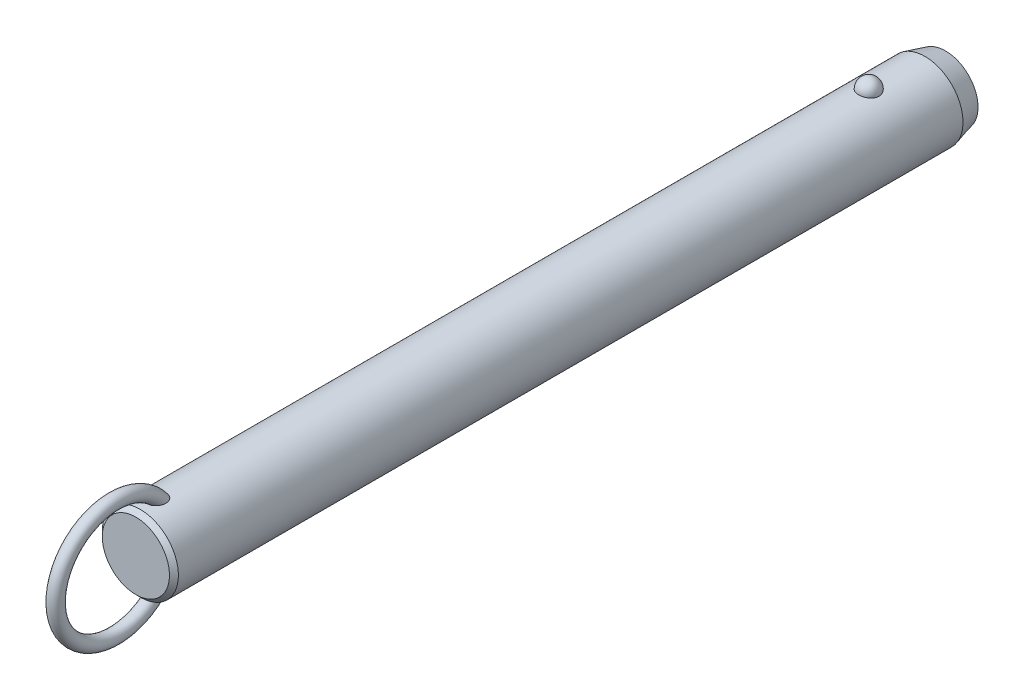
ISO-10303-21;
HEADER;
FILE_DESCRIPTION(('STEP AP214'),'2;1');
FILE_NAME('part.step','',(''),(''),'','','');
FILE_SCHEMA(('AUTOMOTIVE_DESIGN { 1 0 10303 214 1 1 1 1 }'));
ENDSEC;
DATA;
#1=APPLICATION_CONTEXT('core data for automotive mechanical design processes');
#2=APPLICATION_PROTOCOL_DEFINITION('international standard','automotive_design',2000,#1);
#3=PRODUCT_CONTEXT('',#1,'mechanical');
#4=PRODUCT('Part','Part','',(#3));
#5=PRODUCT_RELATED_PRODUCT_CATEGORY('part','',(#4));
#6=PRODUCT_DEFINITION_FORMATION('','',#4);
#7=PRODUCT_DEFINITION_CONTEXT('part definition',#1,'design');
#8=PRODUCT_DEFINITION('design','',#6,#7);
#9=PRODUCT_DEFINITION_SHAPE('','',#8);
#10=(LENGTH_UNIT() NAMED_UNIT(*) SI_UNIT(.MILLI.,.METRE.));
#11=(NAMED_UNIT(*) PLANE_ANGLE_UNIT() SI_UNIT($,.RADIAN.));
#12=(NAMED_UNIT(*) SI_UNIT($,.STERADIAN.) SOLID_ANGLE_UNIT());
#13=UNCERTAINTY_MEASURE_WITH_UNIT(LENGTH_MEASURE(1.E-05),#10,'distance_accuracy_value','');
#14=(GEOMETRIC_REPRESENTATION_CONTEXT(3) GLOBAL_UNCERTAINTY_ASSIGNED_CONTEXT((#13)) GLOBAL_UNIT_ASSIGNED_CONTEXT((#10,
#11,#12)) REPRESENTATION_CONTEXT('',''));
#15=CARTESIAN_POINT('',(0.,0.,0.));
#16=DIRECTION('',(0.,0.,1.));
#17=DIRECTION('',(1.,0.,0.));
#18=AXIS2_PLACEMENT_3D('',#15,#16,#17);
#19=CARTESIAN_POINT('',(0.,0.,198.1));
#20=DIRECTION('',(0.,0.,-1.));
#21=DIRECTION('',(-1.,0.,0.));
#22=AXIS2_PLACEMENT_3D('',#19,#20,#21);
#23=CYLINDRICAL_SURFACE('',#22,11.1);
#24=CARTESIAN_POINT('',(2.9724815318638,10.6945945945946,-3.00000000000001));
#25=CARTESIAN_POINT('',(2.97247830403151,10.6945972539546,-2.8322505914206));
#26=CARTESIAN_POINT('',(2.95876598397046,10.6984356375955,-2.66445972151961));
#27=CARTESIAN_POINT('',(2.90424529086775,10.7133624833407,-2.3336238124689));
#28=CARTESIAN_POINT('',(2.8634252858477,10.7244540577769,-2.17058084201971));
#29=CARTESIAN_POINT('',(2.75573657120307,10.7526272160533,-1.85396767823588));
#30=CARTESIAN_POINT('',(2.68887937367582,10.7697061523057,-1.70039333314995));
#31=CARTESIAN_POINT('',(2.53079696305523,10.8079438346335,-1.4069159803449));
#32=CARTESIAN_POINT('',(2.43957264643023,10.8291024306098,-1.26701246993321));
#33=CARTESIAN_POINT('',(2.23458150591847,10.8732541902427,-1.00409565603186));
#34=CARTESIAN_POINT('',(2.12071295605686,10.8962553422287,-0.881162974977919));
#35=CARTESIAN_POINT('',(1.87365402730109,10.9414421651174,-0.656352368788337));
#36=CARTESIAN_POINT('',(1.74046358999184,10.9636278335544,-0.554474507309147));
#37=CARTESIAN_POINT('',(1.45872188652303,11.0046495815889,-0.374872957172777));
#38=CARTESIAN_POINT('',(1.31021276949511,11.0234944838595,-0.297085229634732));
#39=CARTESIAN_POINT('',(1.00170030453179,11.0557957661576,-0.167529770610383));
#40=CARTESIAN_POINT('',(0.841698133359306,11.0692526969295,-0.1157593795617));
#41=CARTESIAN_POINT('',(0.517607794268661,11.0890932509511,-0.0403925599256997));
#42=CARTESIAN_POINT('',(0.353633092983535,11.0955916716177,-0.0163383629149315));
#43=CARTESIAN_POINT('',(0.0238420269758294,11.1011989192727,0.00445177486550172));
#44=CARTESIAN_POINT('',(-0.141974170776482,11.1003084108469,0.00119017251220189));
#45=CARTESIAN_POINT('',(-0.468405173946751,11.0912990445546,-0.0323233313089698));
#46=CARTESIAN_POINT('',(-0.629059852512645,11.0832767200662,-0.062214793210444));
#47=CARTESIAN_POINT('',(-0.942937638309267,11.0609962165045,-0.147645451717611));
#48=CARTESIAN_POINT('',(-1.09616062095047,11.0467379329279,-0.203185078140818));
#49=CARTESIAN_POINT('',(-1.39181061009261,11.0134071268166,-0.338752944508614));
#50=CARTESIAN_POINT('',(-1.53417383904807,10.9943086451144,-0.418913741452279));
#51=CARTESIAN_POINT('',(-1.80342160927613,10.9533667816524,-0.601448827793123));
#52=CARTESIAN_POINT('',(-1.9303046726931,10.9315231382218,-0.703825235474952));
#53=CARTESIAN_POINT('',(-2.16747598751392,10.887005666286,-0.930091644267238));
#54=CARTESIAN_POINT('',(-2.27742774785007,10.8643239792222,-1.05433291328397));
#55=CARTESIAN_POINT('',(-2.47517316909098,10.8209886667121,-1.31966633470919));
#56=CARTESIAN_POINT('',(-2.56296538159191,10.8003351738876,-1.46075958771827));
#57=CARTESIAN_POINT('',(-2.71500300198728,10.7631304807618,-1.75753646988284));
#58=CARTESIAN_POINT('',(-2.77898901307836,10.7466250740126,-1.91335887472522));
#59=CARTESIAN_POINT('',(-2.88046189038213,10.7198747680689,-2.23391529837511));
#60=CARTESIAN_POINT('',(-2.91794947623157,10.709629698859,-2.3986490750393));
#61=CARTESIAN_POINT('',(-2.96537819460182,10.6965949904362,-2.73165170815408));
#62=CARTESIAN_POINT('',(-2.97542891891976,10.693775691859,-2.89990378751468));
#63=CARTESIAN_POINT('',(-2.96804271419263,10.6958279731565,-3.23575286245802));
#64=CARTESIAN_POINT('',(-2.95060646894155,10.7006993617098,-3.4033498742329));
#65=CARTESIAN_POINT('',(-2.88883358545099,10.71753912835,-3.73233906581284));
#66=CARTESIAN_POINT('',(-2.84462026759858,10.7294749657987,-3.89375610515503));
#67=CARTESIAN_POINT('',(-2.73050447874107,10.7590797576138,-4.20667949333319));
#68=CARTESIAN_POINT('',(-2.66060103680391,10.7767489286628,-4.35818546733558));
#69=CARTESIAN_POINT('',(-2.49642559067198,10.8159599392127,-4.64785421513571));
#70=CARTESIAN_POINT('',(-2.40203047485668,10.8375211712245,-4.78594458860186));
#71=CARTESIAN_POINT('',(-2.19143488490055,10.8820570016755,-5.04410382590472));
#72=CARTESIAN_POINT('',(-2.07523364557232,10.9050316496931,-5.16417205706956));
#73=CARTESIAN_POINT('',(-1.82361254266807,10.9499219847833,-5.3833483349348));
#74=CARTESIAN_POINT('',(-1.68812945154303,10.9718338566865,-5.48238464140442));
#75=CARTESIAN_POINT('',(-1.40191298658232,11.0120611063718,-5.65618873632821));
#76=CARTESIAN_POINT('',(-1.25118062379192,11.0303767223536,-5.73095813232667));
#77=CARTESIAN_POINT('',(-0.940570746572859,11.0611653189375,-5.85334725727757));
#78=CARTESIAN_POINT('',(-0.780821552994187,11.0737044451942,-5.90127578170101));
#79=CARTESIAN_POINT('',(-0.455204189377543,11.0918598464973,-5.96992976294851));
#80=CARTESIAN_POINT('',(-0.289336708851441,11.0974768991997,-5.99065827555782));
#81=CARTESIAN_POINT('',(0.0406846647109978,11.1011307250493,-6.00418773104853));
#82=CARTESIAN_POINT('',(0.204817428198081,11.099299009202,-5.9974731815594));
#83=CARTESIAN_POINT('',(0.5295530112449,11.088551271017,-5.95740317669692));
#84=CARTESIAN_POINT('',(0.69015594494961,11.0796354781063,-5.92404858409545));
#85=CARTESIAN_POINT('',(1.0027760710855,11.0557204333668,-5.83180084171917));
#86=CARTESIAN_POINT('',(1.15482001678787,11.0407414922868,-5.7729929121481));
#87=CARTESIAN_POINT('',(1.44678373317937,11.0062913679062,-5.63147366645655));
#88=CARTESIAN_POINT('',(1.58670279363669,10.9868199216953,-5.54876095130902));
#89=CARTESIAN_POINT('',(1.8527023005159,10.9451315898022,-5.36027644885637));
#90=CARTESIAN_POINT('',(1.97855158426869,10.9228788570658,-5.25418644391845));
#91=CARTESIAN_POINT('',(2.21080872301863,10.8782509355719,-5.02251354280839));
#92=CARTESIAN_POINT('',(2.31721312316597,10.8558757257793,-4.89692718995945));
#93=CARTESIAN_POINT('',(2.5094551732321,10.8130715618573,-4.62745408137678));
#94=CARTESIAN_POINT('',(2.59493284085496,10.7926798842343,-4.48330448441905));
#95=CARTESIAN_POINT('',(2.740862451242,10.7565495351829,-4.18236358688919));
#96=CARTESIAN_POINT('',(2.80132490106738,10.7408089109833,-4.02557762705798));
#97=CARTESIAN_POINT('',(2.88959070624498,10.7173718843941,-3.72475308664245));
#98=CARTESIAN_POINT('',(2.92062102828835,10.7088950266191,-3.58171216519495));
#99=CARTESIAN_POINT('',(2.96206765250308,10.6975052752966,-3.29245795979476));
#100=CARTESIAN_POINT('',(2.97248434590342,10.6945922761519,-3.14624473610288));
#101=CARTESIAN_POINT('',(2.9724815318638,10.6945945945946,-3.00000000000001));
#102=B_SPLINE_CURVE_WITH_KNOTS('',3,(#24,#25,#26,#27,#28,#29,#30,#31,#32,#33,#34,#35,#36,#37,
#38,#39,#40,#41,#42,#43,#44,#45,#46,#47,#48,#49,#50,#51,#52,#53,#54,#55,#56,#57,#58,#59,#60,#61,
#62,#63,#64,#65,#66,#67,#68,#69,#70,#71,#72,#73,#74,#75,#76,#77,#78,#79,#80,#81,#82,#83,#84,#85,
#86,#87,#88,#89,#90,#91,#92,#93,#94,#95,#96,#97,#98,#99,#100,#101),.UNSPECIFIED.,.T.,.F.,(4,2,2,
2,2,2,2,2,2,2,2,2,2,2,2,2,2,2,2,2,2,2,2,2,2,2,2,2,2,2,2,2,2,2,2,2,2,2,4),(0.,0.502722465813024,
1.00566079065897,1.5083769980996,2.01107471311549,2.51608392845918,3.02109467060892,
3.52475118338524,4.02835620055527,4.523518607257,5.0186364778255,5.50715297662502,
5.9956776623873,6.48688002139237,6.97812923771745,7.47814366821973,7.9781907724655,
8.48353712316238,8.9888697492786,9.49218093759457,9.99547960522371,10.4964777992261,
10.997494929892,11.5010810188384,12.0046847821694,12.5099796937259,13.0152411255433,
13.5145635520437,14.0138298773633,14.5043200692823,14.9947943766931,15.4836390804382,
15.9725123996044,16.4685040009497,16.9645836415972,17.4686765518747,17.972557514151,
18.410841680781,18.849117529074),.UNSPECIFIED.);
#103=CARTESIAN_POINT('',(2.9724815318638,10.6945945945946,-3.00000000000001));
#104=VERTEX_POINT('',#103);
#105=EDGE_CURVE('E41',#104,#104,#102,.T.);
#106=ORIENTED_EDGE('',*,*,#105,.T.);
#107=EDGE_LOOP('',(#106));
#108=FACE_BOUND('',#107,.T.);
#109=CARTESIAN_POINT('',(0.,0.,209.5));
#110=DIRECTION('',(0.,0.,1.));
#111=DIRECTION('',(1.,0.,0.));
#112=AXIS2_PLACEMENT_3D('',#109,#110,#111);
#113=CIRCLE('',#112,11.1);
#114=CARTESIAN_POINT('',(-11.1,0.,209.5));
#115=VERTEX_POINT('',#114);
#116=EDGE_CURVE('E10',#115,#115,#113,.F.);
#117=ORIENTED_EDGE('',*,*,#116,.T.);
#118=EDGE_LOOP('',(#117));
#119=FACE_BOUND('',#118,.T.);
#120=CARTESIAN_POINT('',(-0.564520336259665,-11.0856356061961,201.757815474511));
#121=CARTESIAN_POINT('',(-0.667202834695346,-11.0804062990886,201.791283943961));
#122=CARTESIAN_POINT('',(-0.766875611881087,-11.0738877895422,201.833835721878));
#123=CARTESIAN_POINT('',(-0.95728412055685,-11.0590576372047,201.935419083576));
#124=CARTESIAN_POINT('',(-1.04801616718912,-11.0507452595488,201.99445742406));
#125=CARTESIAN_POINT('',(-1.21800952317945,-11.0333016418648,202.126529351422));
#126=CARTESIAN_POINT('',(-1.2973080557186,-11.0241732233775,202.199515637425));
#127=CARTESIAN_POINT('',(-1.44337665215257,-11.0060026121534,202.357037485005));
#128=CARTESIAN_POINT('',(-1.51014622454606,-10.9969604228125,202.441573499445));
#129=CARTESIAN_POINT('',(-1.63454620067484,-10.9791841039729,202.625521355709));
#130=CARTESIAN_POINT('',(-1.69127003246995,-10.9705107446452,202.725549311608));
#131=CARTESIAN_POINT('',(-1.7898078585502,-10.9548648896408,202.932790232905));
#132=CARTESIAN_POINT('',(-1.83161214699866,-10.9478935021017,203.040007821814));
#133=CARTESIAN_POINT('',(-1.91557028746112,-10.9335803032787,203.305408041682));
#134=CARTESIAN_POINT('',(-1.95040620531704,-10.9273269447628,203.465980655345));
#135=CARTESIAN_POINT('',(-1.99388326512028,-10.9194709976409,203.790697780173));
#136=CARTESIAN_POINT('',(-2.00248051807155,-10.9178762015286,203.954847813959));
#137=CARTESIAN_POINT('',(-1.99551615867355,-10.9191578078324,204.324650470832));
#138=CARTESIAN_POINT('',(-1.9732206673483,-10.9232807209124,204.530191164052));
#139=CARTESIAN_POINT('',(-1.9152976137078,-10.9335244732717,204.833595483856));
#140=CARTESIAN_POINT('',(-1.89184575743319,-10.9376266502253,204.934088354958));
#141=CARTESIAN_POINT('',(-1.83700674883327,-10.9469720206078,205.132855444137));
#142=CARTESIAN_POINT('',(-1.80562070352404,-10.9522150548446,205.231129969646));
#143=CARTESIAN_POINT('',(-1.73463055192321,-10.9636837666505,205.425914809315));
#144=CARTESIAN_POINT('',(-1.69493416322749,-10.9699202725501,205.522390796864));
#145=CARTESIAN_POINT('',(-1.60745141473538,-10.9830806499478,205.711626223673));
#146=CARTESIAN_POINT('',(-1.55966150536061,-10.9900048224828,205.804384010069));
#147=CARTESIAN_POINT('',(-1.45591812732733,-11.0042280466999,205.984690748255));
#148=CARTESIAN_POINT('',(-1.40000013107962,-11.0115253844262,206.072260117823));
#149=CARTESIAN_POINT('',(-1.27937470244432,-11.0261911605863,206.241029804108));
#150=CARTESIAN_POINT('',(-1.21467835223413,-11.0335594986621,206.32223795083));
#151=CARTESIAN_POINT('',(-1.08218150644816,-11.0473027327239,206.469001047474));
#152=CARTESIAN_POINT('',(-1.01522633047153,-11.0537063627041,206.535309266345));
#153=CARTESIAN_POINT('',(-0.872952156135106,-11.065850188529,206.658378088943));
#154=CARTESIAN_POINT('',(-0.797642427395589,-11.0715911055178,206.715149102));
#155=CARTESIAN_POINT('',(-0.651396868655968,-11.081071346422,206.807515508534));
#156=CARTESIAN_POINT('',(-0.581712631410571,-11.0849841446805,206.845049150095));
#157=CARTESIAN_POINT('',(-0.43706608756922,-11.0916271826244,206.908259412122));
#158=CARTESIAN_POINT('',(-0.362109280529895,-11.0943586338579,206.933948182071));
#159=CARTESIAN_POINT('',(-0.207828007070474,-11.0983242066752,206.971117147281));
#160=CARTESIAN_POINT('',(-0.12846771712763,-11.0995432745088,206.982454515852));
#161=CARTESIAN_POINT('',(0.0309101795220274,-11.1002423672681,206.988965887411));
#162=CARTESIAN_POINT('',(0.110927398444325,-11.0997233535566,206.984148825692));
#163=CARTESIAN_POINT('',(0.25640659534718,-11.097240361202,206.960959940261));
#164=CARTESIAN_POINT('',(0.322235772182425,-11.0955074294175,206.944754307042));
#165=CARTESIAN_POINT('',(0.450635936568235,-11.0910350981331,206.902600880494));
#166=CARTESIAN_POINT('',(0.513205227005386,-11.0882951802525,206.876648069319));
#167=CARTESIAN_POINT('',(0.662626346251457,-11.0805620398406,206.802607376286));
#168=CARTESIAN_POINT('',(0.747127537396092,-11.0751144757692,206.749845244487));
#169=CARTESIAN_POINT('',(0.906756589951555,-11.0631932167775,206.631720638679));
#170=CARTESIAN_POINT('',(0.981859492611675,-11.0567168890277,206.566325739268));
#171=CARTESIAN_POINT('',(1.10712207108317,-11.0447856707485,206.44226337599));
#172=CARTESIAN_POINT('',(1.15909566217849,-11.0394280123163,206.385383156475));
#173=CARTESIAN_POINT('',(1.2579192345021,-11.0286040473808,206.267327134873));
#174=CARTESIAN_POINT('',(1.30476642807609,-11.0231376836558,206.206149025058));
#175=CARTESIAN_POINT('',(1.43818612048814,-11.0068027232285,206.017305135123));
#176=CARTESIAN_POINT('',(1.51751767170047,-10.9960104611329,205.884453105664));
#177=CARTESIAN_POINT('',(1.63597546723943,-10.9788847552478,205.653137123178));
#178=CARTESIAN_POINT('',(1.67988876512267,-10.9722190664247,205.557053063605));
#179=CARTESIAN_POINT('',(1.75953241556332,-10.9597298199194,205.361431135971));
#180=CARTESIAN_POINT('',(1.7952596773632,-10.9539065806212,205.261891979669));
#181=CARTESIAN_POINT('',(1.85844731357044,-10.9433632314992,205.06021118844));
#182=CARTESIAN_POINT('',(1.88591073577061,-10.9386427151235,204.95807052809));
#183=CARTESIAN_POINT('',(1.93234324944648,-10.9305350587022,204.751819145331));
#184=CARTESIAN_POINT('',(1.95131065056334,-10.9271481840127,204.647708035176));
#185=CARTESIAN_POINT('',(1.9904020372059,-10.9201183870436,204.365458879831));
#186=CARTESIAN_POINT('',(2.00221217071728,-10.9179256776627,204.186037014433));
#187=CARTESIAN_POINT('',(1.99711676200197,-10.9188636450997,203.827713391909));
#188=CARTESIAN_POINT('',(1.98026150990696,-10.9219849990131,203.648811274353));
#189=CARTESIAN_POINT('',(1.92151657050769,-10.9324473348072,203.33645144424));
#190=CARTESIAN_POINT('',(1.88605081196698,-10.9386915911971,203.201759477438));
#191=CARTESIAN_POINT('',(1.79393020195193,-10.9541780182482,202.939966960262));
#192=CARTESIAN_POINT('',(1.73729868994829,-10.9634168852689,202.812858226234));
#193=CARTESIAN_POINT('',(1.61237037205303,-10.9824218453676,202.589418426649));
#194=CARTESIAN_POINT('',(1.54715374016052,-10.9918945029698,202.491345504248));
#195=CARTESIAN_POINT('',(1.40127026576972,-11.0114415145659,202.307434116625));
#196=CARTESIAN_POINT('',(1.32060742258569,-11.0215157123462,202.221592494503));
#197=CARTESIAN_POINT('',(1.1447478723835,-11.041168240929,202.065163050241));
#198=CARTESIAN_POINT('',(1.04947805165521,-11.0507437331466,201.994656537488));
#199=CARTESIAN_POINT('',(0.847278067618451,-11.0680789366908,201.872640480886));
#200=CARTESIAN_POINT('',(0.74035174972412,-11.0758392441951,201.821124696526));
#201=CARTESIAN_POINT('',(0.529289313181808,-11.0878275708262,201.743485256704));
#202=CARTESIAN_POINT('',(0.425895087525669,-11.0923259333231,201.715377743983));
#203=CARTESIAN_POINT('',(0.215723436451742,-11.0984001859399,201.677703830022));
#204=CARTESIAN_POINT('',(0.108947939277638,-11.0999777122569,201.668127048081));
#205=CARTESIAN_POINT('',(-0.0938962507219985,-11.1000196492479,201.667877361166));
#206=CARTESIAN_POINT('',(-0.189967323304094,-11.0987797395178,201.675408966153));
#207=CARTESIAN_POINT('',(-0.379657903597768,-11.0939111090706,201.705507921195));
#208=CARTESIAN_POINT('',(-0.47327735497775,-11.0902823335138,201.728075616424));
#209=CARTESIAN_POINT('',(-0.564520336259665,-11.0856356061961,201.757815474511));
#210=B_SPLINE_CURVE_WITH_KNOTS('',3,(#120,#121,#122,#123,#124,#125,#126,#127,#128,#129,#130,
#131,#132,#133,#134,#135,#136,#137,#138,#139,#140,#141,#142,#143,#144,#145,#146,#147,#148,#149,
#150,#151,#152,#153,#154,#155,#156,#157,#158,#159,#160,#161,#162,#163,#164,#165,#166,#167,#168,
#169,#170,#171,#172,#173,#174,#175,#176,#177,#178,#179,#180,#181,#182,#183,#184,#185,#186,#187,
#188,#189,#190,#191,#192,#193,#194,#195,#196,#197,#198,#199,#200,#201,#202,#203,#204,#205,#206,
#207,#208,#209),.UNSPECIFIED.,.T.,.F.,(4,2,2,2,2,2,2,2,2,2,2,2,2,2,2,2,2,2,2,2,2,2,2,2,2,2,2,2,
2,2,2,2,2,2,2,2,2,2,2,2,2,2,2,2,4),(0.,0.323999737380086,0.64813245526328,0.971184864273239,
1.29424994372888,1.63886237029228,1.98369857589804,2.47426059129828,2.96564271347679,
3.58257396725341,3.89215258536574,4.20168803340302,4.51486273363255,4.82817514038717,
5.14015911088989,5.45175282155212,5.73442856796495,6.01679375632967,6.2536458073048,
6.49025437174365,6.72919963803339,6.96801276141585,7.17061258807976,7.37331685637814,
7.67094989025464,7.96935728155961,8.20075067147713,8.43226927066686,8.89581623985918,
9.21306533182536,9.53043400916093,9.84768549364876,10.1650000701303,10.7022930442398,
11.2386443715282,11.655339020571,12.071575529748,12.4245637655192,12.7774607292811,
13.1321855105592,13.4867936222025,13.8068771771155,14.1267813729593,14.4146787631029,
14.7025827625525),.UNSPECIFIED.);
#211=CARTESIAN_POINT('',(-0.564520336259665,-11.0856356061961,201.757815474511));
#212=VERTEX_POINT('',#211);
#213=EDGE_CURVE('E60',#212,#212,#210,.T.);
#214=ORIENTED_EDGE('',*,*,#213,.T.);
#215=EDGE_LOOP('',(#214));
#216=FACE_BOUND('',#215,.T.);
#217=CARTESIAN_POINT('',(-0.564520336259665,11.0856356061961,201.757815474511));
#218=CARTESIAN_POINT('',(-0.468542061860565,11.0905203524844,201.726545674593));
#219=CARTESIAN_POINT('',(-0.369793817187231,11.0942886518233,201.703157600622));
#220=CARTESIAN_POINT('',(-0.169555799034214,11.0991586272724,201.673085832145));
#221=CARTESIAN_POINT('',(-0.0680604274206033,11.1002543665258,201.66643932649));
#222=CARTESIAN_POINT('',(0.134549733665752,11.099646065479,201.670157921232));
#223=CARTESIAN_POINT('',(0.235664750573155,11.0979441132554,201.68051033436));
#224=CARTESIAN_POINT('',(0.434632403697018,11.0919342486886,201.717831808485));
#225=CARTESIAN_POINT('',(0.532486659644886,11.0876276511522,201.744792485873));
#226=CARTESIAN_POINT('',(0.722445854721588,11.0768742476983,201.8144096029));
#227=CARTESIAN_POINT('',(0.814543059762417,11.0704246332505,201.857086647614));
#228=CARTESIAN_POINT('',(0.990565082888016,11.0560659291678,201.956648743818));
#229=CARTESIAN_POINT('',(1.07448844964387,11.048156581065,202.013536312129));
#230=CARTESIAN_POINT('',(1.23562672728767,11.0313221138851,202.142210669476));
#231=CARTESIAN_POINT('',(1.3124268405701,11.0223686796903,202.214511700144));
#232=CARTESIAN_POINT('',(1.45398030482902,11.0045918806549,202.370042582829));
#233=CARTESIAN_POINT('',(1.51873073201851,10.9957685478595,202.453275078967));
#234=CARTESIAN_POINT('',(1.64107232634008,10.9782087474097,202.636384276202));
#235=CARTESIAN_POINT('',(1.6974317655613,10.9695572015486,202.737089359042));
#236=CARTESIAN_POINT('',(1.79515063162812,10.9539887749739,202.945626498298));
#237=CARTESIAN_POINT('',(1.83649966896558,10.9470730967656,203.05346343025));
#238=CARTESIAN_POINT('',(1.91931148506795,10.9329211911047,203.320399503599));
#239=CARTESIAN_POINT('',(1.95340104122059,10.9267904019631,203.481861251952));
#240=CARTESIAN_POINT('',(1.99526195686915,10.9192174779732,203.80821631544));
#241=CARTESIAN_POINT('',(2.00298989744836,10.9177830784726,203.97311484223));
#242=CARTESIAN_POINT('',(1.99396251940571,10.9194420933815,204.344100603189));
#243=CARTESIAN_POINT('',(1.97050829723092,10.923774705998,204.55003871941));
#244=CARTESIAN_POINT('',(1.91079643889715,10.9343131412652,204.853901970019));
#245=CARTESIAN_POINT('',(1.88673702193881,10.9385106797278,204.954529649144));
#246=CARTESIAN_POINT('',(1.8306550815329,10.9480376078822,205.153510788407));
#247=CARTESIAN_POINT('',(1.79863369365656,10.9533668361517,205.251864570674));
#248=CARTESIAN_POINT('',(1.72633365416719,10.9649954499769,205.446720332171));
#249=CARTESIAN_POINT('',(1.68596409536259,10.9713053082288,205.54318790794));
#250=CARTESIAN_POINT('',(1.59707998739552,10.9845964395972,205.732323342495));
#251=CARTESIAN_POINT('',(1.54856169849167,10.9915780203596,205.824989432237));
#252=CARTESIAN_POINT('',(1.44330168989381,11.0058935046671,206.004975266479));
#253=CARTESIAN_POINT('',(1.3865974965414,11.0132257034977,206.092316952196));
#254=CARTESIAN_POINT('',(1.2643115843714,11.0279330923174,206.260456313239));
#255=CARTESIAN_POINT('',(1.19874160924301,11.0353082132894,206.341262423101));
#256=CARTESIAN_POINT('',(1.06542088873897,11.048931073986,206.485985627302));
#257=CARTESIAN_POINT('',(0.998640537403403,11.0552153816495,206.550784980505));
#258=CARTESIAN_POINT('',(0.856896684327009,11.0671032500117,206.670846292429));
#259=CARTESIAN_POINT('',(0.781942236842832,11.0727075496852,206.726118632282));
#260=CARTESIAN_POINT('',(0.636276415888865,11.081949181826,206.815972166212));
#261=CARTESIAN_POINT('',(0.566755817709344,11.0857572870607,206.852441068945));
#262=CARTESIAN_POINT('',(0.422602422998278,11.0921860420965,206.913533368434));
#263=CARTESIAN_POINT('',(0.347974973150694,11.0948079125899,206.938168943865));
#264=CARTESIAN_POINT('',(0.194593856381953,11.0985608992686,206.973323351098));
#265=CARTESIAN_POINT('',(0.115807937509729,11.0996777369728,206.983706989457));
#266=CARTESIAN_POINT('',(-0.0422499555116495,11.1002003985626,206.988574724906));
#267=CARTESIAN_POINT('',(-0.121521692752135,11.09960699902,206.983066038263));
#268=CARTESIAN_POINT('',(-0.266046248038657,11.0970123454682,206.958827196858));
#269=CARTESIAN_POINT('',(-0.331661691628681,11.0952283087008,206.942135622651));
#270=CARTESIAN_POINT('',(-0.459588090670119,11.0906663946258,206.899111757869));
#271=CARTESIAN_POINT('',(-0.52189737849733,11.0878880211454,206.872774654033));
#272=CARTESIAN_POINT('',(-0.671446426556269,11.0800342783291,206.797513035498));
#273=CARTESIAN_POINT('',(-0.756250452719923,11.0744969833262,206.743818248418));
#274=CARTESIAN_POINT('',(-0.916349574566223,11.0624045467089,206.623802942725));
#275=CARTESIAN_POINT('',(-0.991618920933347,11.0558467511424,206.557449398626));
#276=CARTESIAN_POINT('',(-1.11713140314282,11.0437783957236,206.431633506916));
#277=CARTESIAN_POINT('',(-1.1692053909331,11.0383619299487,206.373952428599));
#278=CARTESIAN_POINT('',(-1.26817476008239,11.02743010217,206.254280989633));
#279=CARTESIAN_POINT('',(-1.31506731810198,11.0219146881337,206.192288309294));
#280=CARTESIAN_POINT('',(-1.40399813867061,11.0109399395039,206.064784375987));
#281=CARTESIAN_POINT('',(-1.44602864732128,11.0054807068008,205.999267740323));
#282=CARTESIAN_POINT('',(-1.52538779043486,10.9947621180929,205.865422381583));
#283=CARTESIAN_POINT('',(-1.56271516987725,10.9895028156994,205.797092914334));
#284=CARTESIAN_POINT('',(-1.64537943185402,10.9774790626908,205.633210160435));
#285=CARTESIAN_POINT('',(-1.68879497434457,10.9708503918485,205.5366735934));
#286=CARTESIAN_POINT('',(-1.76740738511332,10.9584602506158,205.340236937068));
#287=CARTESIAN_POINT('',(-1.80260120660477,10.95269910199,205.24033561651));
#288=CARTESIAN_POINT('',(-1.86468657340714,10.9423003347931,205.037966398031));
#289=CARTESIAN_POINT('',(-1.8915816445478,10.9376622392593,204.935499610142));
#290=CARTESIAN_POINT('',(-1.93682458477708,10.9297405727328,204.728642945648));
#291=CARTESIAN_POINT('',(-1.95517082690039,10.9264572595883,204.624252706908));
#292=CARTESIAN_POINT('',(-1.99232562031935,10.9197647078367,204.34262876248));
#293=CARTESIAN_POINT('',(-2.00294603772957,10.9177914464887,204.164185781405));
#294=CARTESIAN_POINT('',(-1.99566675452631,10.9191290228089,203.807996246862));
#295=CARTESIAN_POINT('',(-1.97781651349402,10.9224306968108,203.63024902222));
#296=CARTESIAN_POINT('',(-1.91747214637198,10.9331592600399,203.319792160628));
#297=CARTESIAN_POINT('',(-1.88131022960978,10.9395108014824,203.185825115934));
#298=CARTESIAN_POINT('',(-1.78790380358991,10.9551659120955,202.92559757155));
#299=CARTESIAN_POINT('',(-1.73068309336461,10.9644661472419,202.799328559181));
#300=CARTESIAN_POINT('',(-1.60475573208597,10.9835398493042,202.57741565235));
#301=CARTESIAN_POINT('',(-1.53908879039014,10.9930297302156,202.480026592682));
#302=CARTESIAN_POINT('',(-1.39238608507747,11.0125708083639,202.297525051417));
#303=CARTESIAN_POINT('',(-1.31135150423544,11.0226219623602,202.212411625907));
#304=CARTESIAN_POINT('',(-1.14382035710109,11.0411991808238,202.06529943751));
#305=CARTESIAN_POINT('',(-1.0585850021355,11.0497792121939,202.00186930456));
#306=CARTESIAN_POINT('',(-0.878723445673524,11.0655285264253,201.890250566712));
#307=CARTESIAN_POINT('',(-0.784123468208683,11.0727015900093,201.842020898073));
#308=CARTESIAN_POINT('',(-0.646163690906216,11.0812501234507,201.786023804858));
#309=CARTESIAN_POINT('',(-0.605595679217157,11.0835451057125,201.771197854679));
#310=CARTESIAN_POINT('',(-0.564520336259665,11.0856356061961,201.757815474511));
#311=B_SPLINE_CURVE_WITH_KNOTS('',3,(#217,#218,#219,#220,#221,#222,#223,#224,#225,#226,#227,
#228,#229,#230,#231,#232,#233,#234,#235,#236,#237,#238,#239,#240,#241,#242,#243,#244,#245,#246,
#247,#248,#249,#250,#251,#252,#253,#254,#255,#256,#257,#258,#259,#260,#261,#262,#263,#264,#265,
#266,#267,#268,#269,#270,#271,#272,#273,#274,#275,#276,#277,#278,#279,#280,#281,#282,#283,#284,
#285,#286,#287,#288,#289,#290,#291,#292,#293,#294,#295,#296,#297,#298,#299,#300,#301,#302,#303,
#304,#305,#306,#307,#308,#309,#310),.UNSPECIFIED.,.T.,.F.,(4,2,2,2,2,2,2,2,2,2,2,2,2,2,2,2,2,2,
2,2,2,2,2,2,2,2,2,2,2,2,2,2,2,2,2,2,2,2,2,2,2,2,2,2,2,2,4),(0.,0.303061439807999,
0.606795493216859,0.910302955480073,1.21365733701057,1.51741085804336,1.82121821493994,
2.13745205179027,2.45376252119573,2.79958678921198,3.14564996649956,3.63832391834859,
4.13180893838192,4.75031912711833,5.06071926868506,5.37107516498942,5.6850077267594,
5.99908475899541,6.31176519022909,6.62403542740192,6.90315673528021,7.18197194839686,
7.41687778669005,7.65154134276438,7.88841587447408,8.12518286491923,8.32752842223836,
8.52997509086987,8.82986421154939,9.13054668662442,9.36393502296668,9.59744991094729,
9.83133221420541,10.0652767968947,10.383032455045,10.7009056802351,11.0186436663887,
11.3364420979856,11.8705925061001,12.4038159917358,12.8189662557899,13.2336487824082,
13.5857049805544,13.9377340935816,14.2561354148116,14.5736690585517,14.7033687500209),.UNSPECIFIED.);
#312=CARTESIAN_POINT('',(-0.564520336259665,11.0856356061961,201.757815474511));
#313=VERTEX_POINT('',#312);
#314=EDGE_CURVE('E68',#313,#313,#311,.T.);
#315=ORIENTED_EDGE('',*,*,#314,.T.);
#316=EDGE_LOOP('',(#315));
#317=FACE_BOUND('',#316,.T.);
#318=CARTESIAN_POINT('',(0.,0.,-19.3999999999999));
#319=DIRECTION('',(0.,0.,-1.));
#320=DIRECTION('',(-1.,0.,0.));
#321=AXIS2_PLACEMENT_3D('',#318,#319,#320);
#322=CIRCLE('',#321,11.1);
#323=CARTESIAN_POINT('',(-11.1,0.,-19.3999999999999));
#324=VERTEX_POINT('',#323);
#325=EDGE_CURVE('E57',#324,#324,#322,.F.);
#326=ORIENTED_EDGE('',*,*,#325,.T.);
#327=EDGE_LOOP('',(#326));
#328=FACE_BOUND('',#327,.T.);
#329=ADVANCED_FACE('F37',(#108,#119,#216,#317,#328),#23,.T.);
#330=CARTESIAN_POINT('',(0.,0.,-25.4));
#331=DIRECTION('',(0.,0.,-1.));
#332=DIRECTION('',(-1.,0.,0.));
#333=AXIS2_PLACEMENT_3D('',#330,#331,#332);
#334=PLANE('',#333);
#335=CARTESIAN_POINT('',(0.,0.,-25.4));
#336=DIRECTION('',(0.,0.,-1.));
#337=DIRECTION('',(-1.,0.,0.));
#338=AXIS2_PLACEMENT_3D('',#335,#336,#337);
#339=CIRCLE('',#338,9.49230484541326);
#340=CARTESIAN_POINT('',(-9.49230484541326,0.,-25.4));
#341=VERTEX_POINT('',#340);
#342=EDGE_CURVE('E67',#341,#341,#339,.T.);
#343=ORIENTED_EDGE('',*,*,#342,.T.);
#344=EDGE_LOOP('',(#343));
#345=FACE_BOUND('',#344,.T.);
#346=ADVANCED_FACE('F86',(#345),#334,.T.);
#347=CARTESIAN_POINT('',(0.,0.,-25.4));
#348=DIRECTION('',(0.,0.,1.));
#349=DIRECTION('',(1.,0.,0.));
#350=AXIS2_PLACEMENT_3D('',#347,#348,#349);
#351=CONICAL_SURFACE('',#350,9.49230484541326,0.261799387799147);
#352=ORIENTED_EDGE('',*,*,#325,.F.);
#353=EDGE_LOOP('',(#352));
#354=FACE_BOUND('',#353,.T.);
#355=ORIENTED_EDGE('',*,*,#342,.F.);
#356=EDGE_LOOP('',(#355));
#357=FACE_BOUND('',#356,.T.);
#358=ADVANCED_FACE('F84',(#354,#357),#351,.T.);
#359=CARTESIAN_POINT('',(0.,0.,210.8));
#360=DIRECTION('',(0.,0.,1.));
#361=DIRECTION('',(1.,0.,0.));
#362=AXIS2_PLACEMENT_3D('',#359,#360,#361);
#363=PLANE('',#362);
#364=CARTESIAN_POINT('',(0.,0.,210.8));
#365=DIRECTION('',(0.,0.,1.));
#366=DIRECTION('',(1.,0.,0.));
#367=AXIS2_PLACEMENT_3D('',#364,#365,#366);
#368=CIRCLE('',#367,9.8);
#369=CARTESIAN_POINT('',(-9.80000000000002,0.,210.8));
#370=VERTEX_POINT('',#369);
#371=EDGE_CURVE('E50',#370,#370,#368,.T.);
#372=ORIENTED_EDGE('',*,*,#371,.T.);
#373=EDGE_LOOP('',(#372));
#374=FACE_BOUND('',#373,.T.);
#375=ADVANCED_FACE('F78',(#374),#363,.T.);
#376=CARTESIAN_POINT('',(0.,0.,217.15));
#377=DIRECTION('',(1.,0.,0.));
#378=DIRECTION('',(0.,0.,-1.));
#379=AXIS2_PLACEMENT_3D('',#376,#377,#378);
#380=TOROIDAL_SURFACE('',#379,17.05,2.);
#381=ORIENTED_EDGE('',*,*,#314,.F.);
#382=EDGE_LOOP('',(#381));
#383=FACE_BOUND('',#382,.T.);
#384=ORIENTED_EDGE('',*,*,#213,.F.);
#385=EDGE_LOOP('',(#384));
#386=FACE_BOUND('',#385,.T.);
#387=ADVANCED_FACE('F74',(#383,#386),#380,.T.);
#388=CARTESIAN_POINT('',(0.,0.,210.8));
#389=DIRECTION('',(0.,0.,-1.));
#390=DIRECTION('',(-1.,0.,0.));
#391=AXIS2_PLACEMENT_3D('',#388,#389,#390);
#392=CONICAL_SURFACE('',#391,9.8,0.785398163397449);
#393=CARTESIAN_POINT('',(-11.1,0.,209.5));
#394=CARTESIAN_POINT('',(-11.0864583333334,0.,209.513541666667));
#395=CARTESIAN_POINT('',(-11.0729166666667,0.,209.527083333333));
#396=CARTESIAN_POINT('',(-11.0458333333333,0.,209.554166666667));
#397=CARTESIAN_POINT('',(-11.0322916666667,0.,209.567708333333));
#398=CARTESIAN_POINT('',(-11.0052083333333,0.,209.594791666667));
#399=CARTESIAN_POINT('',(-10.9916666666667,0.,209.608333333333));
#400=CARTESIAN_POINT('',(-10.9645833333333,0.,209.635416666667));
#401=CARTESIAN_POINT('',(-10.9510416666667,0.,209.648958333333));
#402=CARTESIAN_POINT('',(-10.9239583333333,0.,209.676041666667));
#403=CARTESIAN_POINT('',(-10.9104166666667,0.,209.689583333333));
#404=CARTESIAN_POINT('',(-10.8833333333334,0.,209.716666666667));
#405=CARTESIAN_POINT('',(-10.8697916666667,0.,209.730208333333));
#406=CARTESIAN_POINT('',(-10.8427083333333,0.,209.757291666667));
#407=CARTESIAN_POINT('',(-10.8291666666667,0.,209.770833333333));
#408=CARTESIAN_POINT('',(-10.8020833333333,0.,209.797916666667));
#409=CARTESIAN_POINT('',(-10.7885416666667,0.,209.811458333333));
#410=CARTESIAN_POINT('',(-10.7614583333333,0.,209.838541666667));
#411=CARTESIAN_POINT('',(-10.7479166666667,0.,209.852083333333));
#412=CARTESIAN_POINT('',(-10.7208333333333,0.,209.879166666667));
#413=CARTESIAN_POINT('',(-10.7072916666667,0.,209.892708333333));
#414=CARTESIAN_POINT('',(-10.6802083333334,0.,209.919791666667));
#415=CARTESIAN_POINT('',(-10.6666666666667,0.,209.933333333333));
#416=CARTESIAN_POINT('',(-10.6395833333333,0.,209.960416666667));
#417=CARTESIAN_POINT('',(-10.6260416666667,0.,209.973958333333));
#418=CARTESIAN_POINT('',(-10.5989583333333,0.,210.001041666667));
#419=CARTESIAN_POINT('',(-10.5854166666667,0.,210.014583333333));
#420=CARTESIAN_POINT('',(-10.5583333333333,0.,210.041666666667));
#421=CARTESIAN_POINT('',(-10.5447916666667,0.,210.055208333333));
#422=CARTESIAN_POINT('',(-10.5177083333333,0.,210.082291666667));
#423=CARTESIAN_POINT('',(-10.5041666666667,0.,210.095833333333));
#424=CARTESIAN_POINT('',(-10.4770833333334,0.,210.122916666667));
#425=CARTESIAN_POINT('',(-10.4635416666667,0.,210.136458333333));
#426=CARTESIAN_POINT('',(-10.4364583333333,0.,210.163541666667));
#427=CARTESIAN_POINT('',(-10.4229166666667,0.,210.177083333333));
#428=CARTESIAN_POINT('',(-10.3958333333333,0.,210.204166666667));
#429=CARTESIAN_POINT('',(-10.3822916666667,0.,210.217708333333));
#430=CARTESIAN_POINT('',(-10.3552083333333,0.,210.244791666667));
#431=CARTESIAN_POINT('',(-10.3416666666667,0.,210.258333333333));
#432=CARTESIAN_POINT('',(-10.3145833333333,0.,210.285416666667));
#433=CARTESIAN_POINT('',(-10.3010416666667,0.,210.298958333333));
#434=CARTESIAN_POINT('',(-10.2739583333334,0.,210.326041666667));
#435=CARTESIAN_POINT('',(-10.2604166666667,0.,210.339583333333));
#436=CARTESIAN_POINT('',(-10.2333333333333,0.,210.366666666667));
#437=CARTESIAN_POINT('',(-10.2197916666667,0.,210.380208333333));
#438=CARTESIAN_POINT('',(-10.1927083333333,0.,210.407291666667));
#439=CARTESIAN_POINT('',(-10.1791666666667,0.,210.420833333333));
#440=CARTESIAN_POINT('',(-10.1520833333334,0.,210.447916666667));
#441=CARTESIAN_POINT('',(-10.1385416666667,0.,210.461458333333));
#442=CARTESIAN_POINT('',(-10.1114583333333,0.,210.488541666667));
#443=CARTESIAN_POINT('',(-10.0979166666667,0.,210.502083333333));
#444=CARTESIAN_POINT('',(-10.0708333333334,0.,210.529166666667));
#445=CARTESIAN_POINT('',(-10.0572916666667,0.,210.542708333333));
#446=CARTESIAN_POINT('',(-10.0302083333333,0.,210.569791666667));
#447=CARTESIAN_POINT('',(-10.0166666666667,0.,210.583333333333));
#448=CARTESIAN_POINT('',(-9.98958333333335,0.,210.610416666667));
#449=CARTESIAN_POINT('',(-9.97604166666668,0.,210.623958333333));
#450=CARTESIAN_POINT('',(-9.94895833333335,0.,210.651041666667));
#451=CARTESIAN_POINT('',(-9.93541666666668,0.,210.664583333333));
#452=CARTESIAN_POINT('',(-9.90833333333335,0.,210.691666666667));
#453=CARTESIAN_POINT('',(-9.89479166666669,0.,210.705208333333));
#454=CARTESIAN_POINT('',(-9.86770833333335,0.,210.732291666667));
#455=CARTESIAN_POINT('',(-9.85416666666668,0.,210.745833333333));
#456=CARTESIAN_POINT('',(-9.82708333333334,0.,210.772916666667));
#457=CARTESIAN_POINT('',(-9.81354166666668,0.,210.786458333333));
#458=CARTESIAN_POINT('',(-9.80000000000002,0.,210.8));
#459=B_SPLINE_CURVE_WITH_KNOTS('',3,(#393,#394,#395,#396,#397,#398,#399,#400,#401,#402,#403,
#404,#405,#406,#407,#408,#409,#410,#411,#412,#413,#414,#415,#416,#417,#418,#419,#420,#421,#422,
#423,#424,#425,#426,#427,#428,#429,#430,#431,#432,#433,#434,#435,#436,#437,#438,#439,#440,#441,
#442,#443,#444,#445,#446,#447,#448,#449,#450,#451,#452,#453,#454,#455,#456,#457,#458),
.UNSPECIFIED.,.F.,.F.,(4,2,2,2,2,2,2,2,2,2,2,2,2,2,2,2,2,2,2,2,2,2,2,2,2,2,2,2,2,2,2,2,4),(0.,
0.0574524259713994,0.114904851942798,0.172357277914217,0.229809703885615,0.287262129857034,
0.344714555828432,0.402166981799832,0.459619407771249,0.517071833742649,0.574524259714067,
0.631976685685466,0.689429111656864,0.746881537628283,0.804333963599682,0.861786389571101,
0.9192388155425,0.976691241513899,1.03414366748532,1.09159609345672,1.14904851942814,
1.20650094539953,1.26395337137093,1.32140579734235,1.37885822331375,1.43631064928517,
1.49376307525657,1.55121550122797,1.60866792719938,1.66612035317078,1.7235727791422,
1.7810252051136,1.83847763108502),.UNSPECIFIED.);
#460=EDGE_CURVE('BSEAM39',#115,#370,#459,.T.);
#461=ORIENTED_EDGE('',*,*,#116,.F.);
#462=ORIENTED_EDGE('',*,*,#371,.F.);
#463=ORIENTED_EDGE('',*,*,#460,.T.);
#464=ORIENTED_EDGE('',*,*,#460,.F.);
#465=EDGE_LOOP('',(#461,#463,#462,#464));
#466=FACE_BOUND('',#465,.T.);
#467=ADVANCED_FACE('F39',(#466),#392,.T.);
#468=CARTESIAN_POINT('',(0.,11.1,-3.00000000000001));
#469=DIRECTION('',(0.,1.,0.));
#470=DIRECTION('',(0.,0.,-1.));
#471=AXIS2_PLACEMENT_3D('',#468,#469,#470);
#472=SPHERICAL_SURFACE('',#471,3.);
#473=ORIENTED_EDGE('',*,*,#105,.F.);
#474=EDGE_LOOP('',(#473));
#475=FACE_BOUND('',#474,.T.);
#476=ADVANCED_FACE('F80',(#475),#472,.T.);
#477=CLOSED_SHELL('',(#329,#346,#358,#375,#387,#467,#476));
#478=MANIFOLD_SOLID_BREP('B2',#477);
#479=ADVANCED_BREP_SHAPE_REPRESENTATION('',(#18,#478),#14);
#480=SHAPE_DEFINITION_REPRESENTATION(#9,#479);
ENDSEC;
END-ISO-10303-21;
